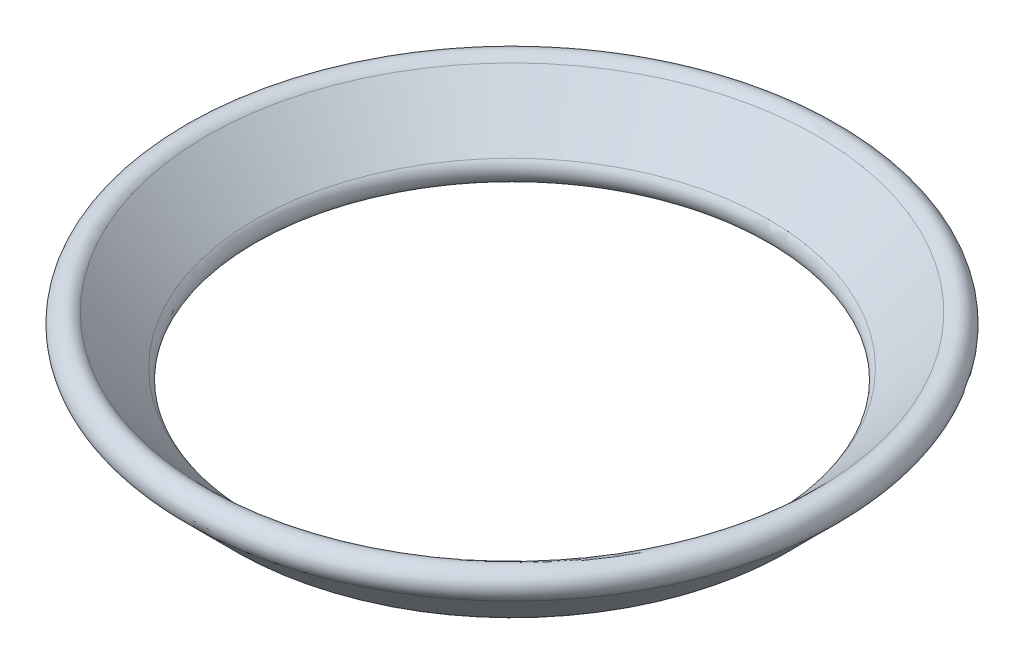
from build123d import *


with BuildPart() as part:
    # Esquisse1 → Base-R_volution (revolve)
    with BuildSketch(Plane.XY, mode=Mode.PRIVATE) as base_r_volution_sk:
        with BuildLine():
            Line((73.633025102, -9.390384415), (71.511704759, -11.511704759))
            ThreePointArc((71.511704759, -11.511704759), (71.511704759, -12.395588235), (72.395588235, -12.395588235))
            Line((72.395588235, -12.395588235), (74.516908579, -10.274267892))
            ThreePointArc((74.516908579, -10.274267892), (74.516908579, -9.390384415), (73.633025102, -9.390384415))
        make_face()
    revolve(base_r_volution_sk.sketch.rotate(Axis((60.233025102, 30, 0), (0, -1, 0)), 180), axis=Axis((60.233025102, 30, 0), (0, -1, 0)))


solid = part.part
